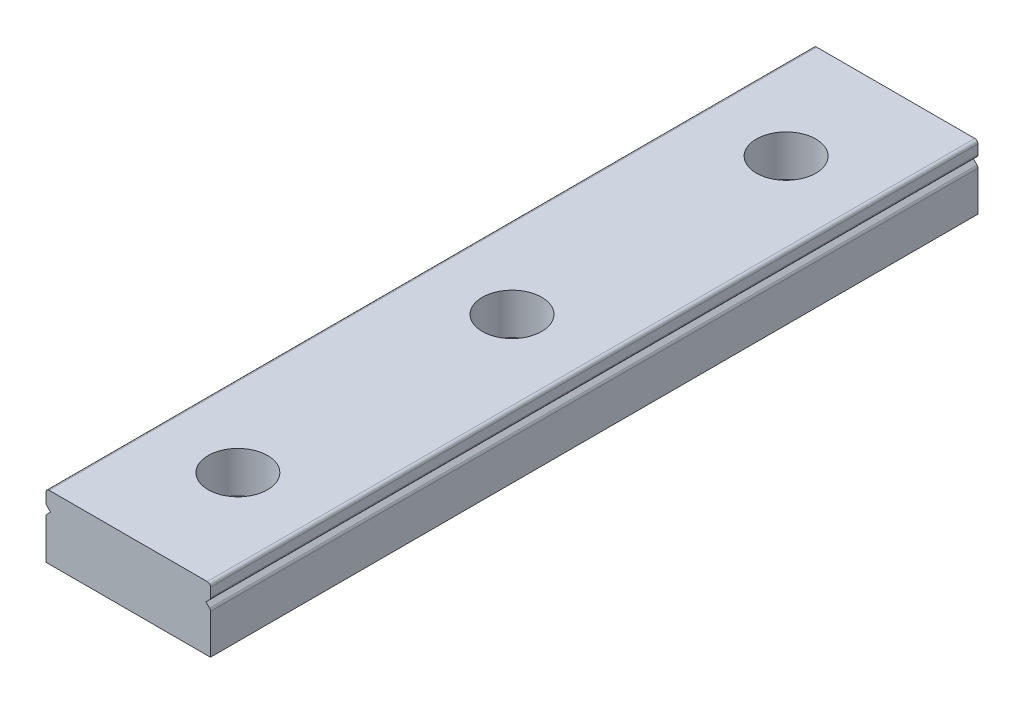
ISO-10303-21;
HEADER;
FILE_DESCRIPTION(('STEP AP214'),'2;1');
FILE_NAME('part.step','',(''),(''),'','','');
FILE_SCHEMA(('AUTOMOTIVE_DESIGN { 1 0 10303 214 1 1 1 1 }'));
ENDSEC;
DATA;
#1=APPLICATION_CONTEXT('core data for automotive mechanical design processes');
#2=APPLICATION_PROTOCOL_DEFINITION('international standard','automotive_design',2000,#1);
#3=PRODUCT_CONTEXT('',#1,'mechanical');
#4=PRODUCT('Part','Part','',(#3));
#5=PRODUCT_RELATED_PRODUCT_CATEGORY('part','',(#4));
#6=PRODUCT_DEFINITION_FORMATION('','',#4);
#7=PRODUCT_DEFINITION_CONTEXT('part definition',#1,'design');
#8=PRODUCT_DEFINITION('design','',#6,#7);
#9=PRODUCT_DEFINITION_SHAPE('','',#8);
#10=(LENGTH_UNIT() NAMED_UNIT(*) SI_UNIT(.MILLI.,.METRE.));
#11=(NAMED_UNIT(*) PLANE_ANGLE_UNIT() SI_UNIT($,.RADIAN.));
#12=(NAMED_UNIT(*) SI_UNIT($,.STERADIAN.) SOLID_ANGLE_UNIT());
#13=UNCERTAINTY_MEASURE_WITH_UNIT(LENGTH_MEASURE(1.E-05),#10,'distance_accuracy_value','');
#14=(GEOMETRIC_REPRESENTATION_CONTEXT(3) GLOBAL_UNCERTAINTY_ASSIGNED_CONTEXT((#13)) GLOBAL_UNIT_ASSIGNED_CONTEXT((#10,
#11,#12)) REPRESENTATION_CONTEXT('',''));
#15=CARTESIAN_POINT('',(0.,0.,0.));
#16=DIRECTION('',(0.,0.,1.));
#17=DIRECTION('',(1.,0.,0.));
#18=AXIS2_PLACEMENT_3D('',#15,#16,#17);
#19=CARTESIAN_POINT('',(0.,0.,84.));
#20=DIRECTION('',(0.,1.,0.));
#21=DIRECTION('',(0.,0.,1.));
#22=AXIS2_PLACEMENT_3D('',#19,#20,#21);
#23=PLANE('',#22);
#24=CARTESIAN_POINT('',(0.,0.,42.));
#25=DIRECTION('',(0.,1.,0.));
#26=DIRECTION('',(0.,0.,1.));
#27=AXIS2_PLACEMENT_3D('',#24,#25,#26);
#28=CIRCLE('',#27,1.75);
#29=CARTESIAN_POINT('',(0.,0.,43.75));
#30=VERTEX_POINT('',#29);
#31=EDGE_CURVE('E686',#30,#30,#28,.T.);
#32=ORIENTED_EDGE('',*,*,#31,.T.);
#33=EDGE_LOOP('',(#32));
#34=FACE_BOUND('',#33,.T.);
#35=CARTESIAN_POINT('',(0.,0.,12.));
#36=DIRECTION('',(0.,1.,0.));
#37=DIRECTION('',(0.,0.,1.));
#38=AXIS2_PLACEMENT_3D('',#35,#36,#37);
#39=CIRCLE('',#38,1.75);
#40=CARTESIAN_POINT('',(0.,0.,13.75));
#41=VERTEX_POINT('',#40);
#42=EDGE_CURVE('E671',#41,#41,#39,.T.);
#43=ORIENTED_EDGE('',*,*,#42,.T.);
#44=EDGE_LOOP('',(#43));
#45=FACE_BOUND('',#44,.T.);
#46=DIRECTION('',(1.,0.,0.));
#47=VECTOR('',#46,1.);
#48=CARTESIAN_POINT('',(0.,0.,0.));
#49=LINE('',#48,#47);
#50=CARTESIAN_POINT('',(-9.,0.,0.));
#51=VERTEX_POINT('',#50);
#52=CARTESIAN_POINT('',(9.,0.,0.));
#53=VERTEX_POINT('',#52);
#54=EDGE_CURVE('E184',#51,#53,#49,.T.);
#55=ORIENTED_EDGE('',*,*,#54,.T.);
#56=DIRECTION('',(0.,0.,-1.));
#57=VECTOR('',#56,1.);
#58=CARTESIAN_POINT('',(9.,0.,84.));
#59=LINE('',#58,#57);
#60=CARTESIAN_POINT('',(9.,0.,84.));
#61=VERTEX_POINT('',#60);
#62=EDGE_CURVE('E257',#61,#53,#59,.T.);
#63=ORIENTED_EDGE('',*,*,#62,.F.);
#64=DIRECTION('',(1.,0.,0.));
#65=VECTOR('',#64,1.);
#66=CARTESIAN_POINT('',(0.,0.,84.));
#67=LINE('',#66,#65);
#68=CARTESIAN_POINT('',(-9.,0.,84.));
#69=VERTEX_POINT('',#68);
#70=EDGE_CURVE('E213',#69,#61,#67,.T.);
#71=ORIENTED_EDGE('',*,*,#70,.F.);
#72=DIRECTION('',(0.,0.,-1.));
#73=VECTOR('',#72,1.);
#74=CARTESIAN_POINT('',(-9.,0.,84.));
#75=LINE('',#74,#73);
#76=EDGE_CURVE('E185',#69,#51,#75,.T.);
#77=ORIENTED_EDGE('',*,*,#76,.T.);
#78=EDGE_LOOP('',(#55,#63,#71,#77));
#79=FACE_BOUND('',#78,.T.);
#80=CARTESIAN_POINT('',(0.,0.,72.));
#81=DIRECTION('',(0.,1.,0.));
#82=DIRECTION('',(0.,0.,1.));
#83=AXIS2_PLACEMENT_3D('',#80,#81,#82);
#84=CIRCLE('',#83,1.75);
#85=CARTESIAN_POINT('',(0.,0.,73.75));
#86=VERTEX_POINT('',#85);
#87=EDGE_CURVE('E328',#86,#86,#84,.T.);
#88=ORIENTED_EDGE('',*,*,#87,.T.);
#89=EDGE_LOOP('',(#88));
#90=FACE_BOUND('',#89,.T.);
#91=ADVANCED_FACE('F41',(#34,#45,#79,#90),#23,.F.);
#92=CARTESIAN_POINT('',(9.,0.,84.));
#93=DIRECTION('',(-1.,0.,0.));
#94=DIRECTION('',(0.,0.,1.));
#95=AXIS2_PLACEMENT_3D('',#92,#93,#94);
#96=PLANE('',#95);
#97=DIRECTION('',(0.,1.,0.));
#98=VECTOR('',#97,1.);
#99=CARTESIAN_POINT('',(9.,0.,0.));
#100=LINE('',#99,#98);
#101=CARTESIAN_POINT('',(9.,4.35502525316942,0.));
#102=VERTEX_POINT('',#101);
#103=EDGE_CURVE('E238',#53,#102,#100,.T.);
#104=ORIENTED_EDGE('',*,*,#103,.T.);
#105=DIRECTION('',(0.,0.,-1.));
#106=VECTOR('',#105,1.);
#107=CARTESIAN_POINT('',(9.,4.35502525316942,84.));
#108=LINE('',#107,#106);
#109=CARTESIAN_POINT('',(9.,4.35502525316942,84.));
#110=VERTEX_POINT('',#109);
#111=EDGE_CURVE('E295',#102,#110,#108,.F.);
#112=ORIENTED_EDGE('',*,*,#111,.T.);
#113=DIRECTION('',(0.,1.,0.));
#114=VECTOR('',#113,1.);
#115=CARTESIAN_POINT('',(9.,0.,84.));
#116=LINE('',#115,#114);
#117=EDGE_CURVE('E216',#61,#110,#116,.T.);
#118=ORIENTED_EDGE('',*,*,#117,.F.);
#119=ORIENTED_EDGE('',*,*,#62,.T.);
#120=EDGE_LOOP('',(#104,#112,#118,#119));
#121=FACE_BOUND('',#120,.T.);
#122=ADVANCED_FACE('F364',(#121),#96,.F.);
#123=CARTESIAN_POINT('',(8.5,5.,84.));
#124=DIRECTION('',(-0.707106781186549,-0.707106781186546,0.));
#125=DIRECTION('',(0.707106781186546,-0.707106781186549,0.));
#126=AXIS2_PLACEMENT_3D('',#123,#124,#125);
#127=PLANE('',#126);
#128=DIRECTION('',(-0.707106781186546,0.707106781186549,0.));
#129=VECTOR('',#128,1.);
#130=CARTESIAN_POINT('',(8.5,5.,84.));
#131=LINE('',#130,#129);
#132=CARTESIAN_POINT('',(8.89748737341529,4.60251262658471,84.));
#133=VERTEX_POINT('',#132);
#134=CARTESIAN_POINT('',(8.5,5.,84.));
#135=VERTEX_POINT('',#134);
#136=EDGE_CURVE('E221',#133,#135,#131,.T.);
#137=ORIENTED_EDGE('',*,*,#136,.F.);
#138=DIRECTION('',(0.,0.,-1.));
#139=VECTOR('',#138,1.);
#140=CARTESIAN_POINT('',(8.89748737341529,4.60251262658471,84.));
#141=LINE('',#140,#139);
#142=CARTESIAN_POINT('',(8.89748737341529,4.60251262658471,0.));
#143=VERTEX_POINT('',#142);
#144=EDGE_CURVE('E291',#133,#143,#141,.T.);
#145=ORIENTED_EDGE('',*,*,#144,.T.);
#146=DIRECTION('',(-0.707106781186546,0.707106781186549,0.));
#147=VECTOR('',#146,1.);
#148=CARTESIAN_POINT('',(8.5,5.,0.));
#149=LINE('',#148,#147);
#150=CARTESIAN_POINT('',(8.5,5.,0.));
#151=VERTEX_POINT('',#150);
#152=EDGE_CURVE('E242',#143,#151,#149,.T.);
#153=ORIENTED_EDGE('',*,*,#152,.T.);
#154=DIRECTION('',(0.,0.,-1.));
#155=VECTOR('',#154,1.);
#156=CARTESIAN_POINT('',(8.5,5.,84.));
#157=LINE('',#156,#155);
#158=EDGE_CURVE('E235',#135,#151,#157,.T.);
#159=ORIENTED_EDGE('',*,*,#158,.F.);
#160=EDGE_LOOP('',(#137,#145,#153,#159));
#161=FACE_BOUND('',#160,.T.);
#162=ADVANCED_FACE('F370',(#161),#127,.F.);
#163=CARTESIAN_POINT('',(9.,5.5,84.));
#164=DIRECTION('',(-0.707106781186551,0.707106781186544,0.));
#165=DIRECTION('',(-0.707106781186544,-0.707106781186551,0.));
#166=AXIS2_PLACEMENT_3D('',#163,#164,#165);
#167=PLANE('',#166);
#168=DIRECTION('',(0.707106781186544,0.707106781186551,0.));
#169=VECTOR('',#168,1.);
#170=CARTESIAN_POINT('',(9.,5.5,0.));
#171=LINE('',#170,#169);
#172=CARTESIAN_POINT('',(8.89748737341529,5.39748737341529,0.));
#173=VERTEX_POINT('',#172);
#174=EDGE_CURVE('E244',#151,#173,#171,.T.);
#175=ORIENTED_EDGE('',*,*,#174,.T.);
#176=DIRECTION('',(0.,0.,-1.));
#177=VECTOR('',#176,1.);
#178=CARTESIAN_POINT('',(8.89748737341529,5.39748737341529,84.));
#179=LINE('',#178,#177);
#180=CARTESIAN_POINT('',(8.89748737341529,5.39748737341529,84.));
#181=VERTEX_POINT('',#180);
#182=EDGE_CURVE('E288',#173,#181,#179,.F.);
#183=ORIENTED_EDGE('',*,*,#182,.T.);
#184=DIRECTION('',(0.707106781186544,0.707106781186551,0.));
#185=VECTOR('',#184,1.);
#186=CARTESIAN_POINT('',(9.,5.5,84.));
#187=LINE('',#186,#185);
#188=EDGE_CURVE('E224',#135,#181,#187,.T.);
#189=ORIENTED_EDGE('',*,*,#188,.F.);
#190=ORIENTED_EDGE('',*,*,#158,.T.);
#191=EDGE_LOOP('',(#175,#183,#189,#190));
#192=FACE_BOUND('',#191,.T.);
#193=ADVANCED_FACE('F357',(#192),#167,.F.);
#194=CARTESIAN_POINT('',(9.,7.,84.));
#195=DIRECTION('',(-1.,0.,0.));
#196=DIRECTION('',(0.,-1.,0.));
#197=AXIS2_PLACEMENT_3D('',#194,#195,#196);
#198=PLANE('',#197);
#199=DIRECTION('',(0.,1.,0.));
#200=VECTOR('',#199,1.);
#201=CARTESIAN_POINT('',(9.,7.,0.));
#202=LINE('',#201,#200);
#203=CARTESIAN_POINT('',(9.,5.64497474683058,0.));
#204=VERTEX_POINT('',#203);
#205=CARTESIAN_POINT('',(9.,6.65,0.));
#206=VERTEX_POINT('',#205);
#207=EDGE_CURVE('E247',#204,#206,#202,.T.);
#208=ORIENTED_EDGE('',*,*,#207,.T.);
#209=DIRECTION('',(0.,0.,-1.));
#210=VECTOR('',#209,1.);
#211=CARTESIAN_POINT('',(9.,6.65,84.));
#212=LINE('',#211,#210);
#213=CARTESIAN_POINT('',(9.,6.65,84.));
#214=VERTEX_POINT('',#213);
#215=EDGE_CURVE('E276',#206,#214,#212,.F.);
#216=ORIENTED_EDGE('',*,*,#215,.T.);
#217=DIRECTION('',(0.,1.,0.));
#218=VECTOR('',#217,1.);
#219=CARTESIAN_POINT('',(9.,7.,84.));
#220=LINE('',#219,#218);
#221=CARTESIAN_POINT('',(9.,5.64497474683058,84.));
#222=VERTEX_POINT('',#221);
#223=EDGE_CURVE('E228',#222,#214,#220,.T.);
#224=ORIENTED_EDGE('',*,*,#223,.F.);
#225=DIRECTION('',(0.,0.,-1.));
#226=VECTOR('',#225,1.);
#227=CARTESIAN_POINT('',(9.,5.64497474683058,84.));
#228=LINE('',#227,#226);
#229=EDGE_CURVE('E272',#222,#204,#228,.T.);
#230=ORIENTED_EDGE('',*,*,#229,.T.);
#231=EDGE_LOOP('',(#208,#216,#224,#230));
#232=FACE_BOUND('',#231,.T.);
#233=ADVANCED_FACE('F348',(#232),#198,.F.);
#234=CARTESIAN_POINT('',(0.,7.,84.));
#235=DIRECTION('',(0.,-1.,0.));
#236=DIRECTION('',(0.,0.,-1.));
#237=AXIS2_PLACEMENT_3D('',#234,#235,#236);
#238=PLANE('',#237);
#239=CARTESIAN_POINT('',(0.,7.,42.));
#240=DIRECTION('',(0.,1.,0.));
#241=DIRECTION('',(0.,0.,1.));
#242=AXIS2_PLACEMENT_3D('',#239,#240,#241);
#243=CIRCLE('',#242,3.25);
#244=CARTESIAN_POINT('',(0.,7.,45.25));
#245=VERTEX_POINT('',#244);
#246=EDGE_CURVE('E682',#245,#245,#243,.T.);
#247=ORIENTED_EDGE('',*,*,#246,.F.);
#248=EDGE_LOOP('',(#247));
#249=FACE_BOUND('',#248,.T.);
#250=CARTESIAN_POINT('',(0.,7.,12.));
#251=DIRECTION('',(0.,1.,0.));
#252=DIRECTION('',(0.,0.,1.));
#253=AXIS2_PLACEMENT_3D('',#250,#251,#252);
#254=CIRCLE('',#253,3.25);
#255=CARTESIAN_POINT('',(0.,7.,15.25));
#256=VERTEX_POINT('',#255);
#257=EDGE_CURVE('E204',#256,#256,#254,.T.);
#258=ORIENTED_EDGE('',*,*,#257,.F.);
#259=EDGE_LOOP('',(#258));
#260=FACE_BOUND('',#259,.T.);
#261=DIRECTION('',(-1.,0.,0.));
#262=VECTOR('',#261,1.);
#263=CARTESIAN_POINT('',(0.,7.,0.));
#264=LINE('',#263,#262);
#265=CARTESIAN_POINT('',(8.65,7.,0.));
#266=VERTEX_POINT('',#265);
#267=CARTESIAN_POINT('',(-8.65,7.,0.));
#268=VERTEX_POINT('',#267);
#269=EDGE_CURVE('E217',#266,#268,#264,.T.);
#270=ORIENTED_EDGE('',*,*,#269,.T.);
#271=DIRECTION('',(0.,0.,-1.));
#272=VECTOR('',#271,1.);
#273=CARTESIAN_POINT('',(-8.65,7.,84.));
#274=LINE('',#273,#272);
#275=CARTESIAN_POINT('',(-8.65,7.,84.));
#276=VERTEX_POINT('',#275);
#277=EDGE_CURVE('E312',#268,#276,#274,.F.);
#278=ORIENTED_EDGE('',*,*,#277,.T.);
#279=DIRECTION('',(-1.,0.,0.));
#280=VECTOR('',#279,1.);
#281=CARTESIAN_POINT('',(0.,7.,84.));
#282=LINE('',#281,#280);
#283=CARTESIAN_POINT('',(8.65,7.,84.));
#284=VERTEX_POINT('',#283);
#285=EDGE_CURVE('E232',#284,#276,#282,.T.);
#286=ORIENTED_EDGE('',*,*,#285,.F.);
#287=DIRECTION('',(0.,0.,-1.));
#288=VECTOR('',#287,1.);
#289=CARTESIAN_POINT('',(8.65,7.,84.));
#290=LINE('',#289,#288);
#291=EDGE_CURVE('E261',#284,#266,#290,.T.);
#292=ORIENTED_EDGE('',*,*,#291,.T.);
#293=EDGE_LOOP('',(#270,#278,#286,#292));
#294=FACE_BOUND('',#293,.T.);
#295=CARTESIAN_POINT('',(0.,7.,72.));
#296=DIRECTION('',(0.,1.,0.));
#297=DIRECTION('',(0.,0.,1.));
#298=AXIS2_PLACEMENT_3D('',#295,#296,#297);
#299=CIRCLE('',#298,3.25);
#300=CARTESIAN_POINT('',(0.,7.,75.25));
#301=VERTEX_POINT('',#300);
#302=EDGE_CURVE('E331',#301,#301,#299,.T.);
#303=ORIENTED_EDGE('',*,*,#302,.F.);
#304=EDGE_LOOP('',(#303));
#305=FACE_BOUND('',#304,.T.);
#306=ADVANCED_FACE('F346',(#249,#260,#294,#305),#238,.F.);
#307=CARTESIAN_POINT('',(0.,0.,84.));
#308=DIRECTION('',(0.,0.,1.));
#309=DIRECTION('',(1.,0.,0.));
#310=AXIS2_PLACEMENT_3D('',#307,#308,#309);
#311=PLANE('',#310);
#312=ORIENTED_EDGE('',*,*,#285,.T.);
#313=CARTESIAN_POINT('',(-8.65,6.65,84.));
#314=DIRECTION('',(0.,0.,1.));
#315=DIRECTION('',(1.,0.,0.));
#316=AXIS2_PLACEMENT_3D('',#313,#314,#315);
#317=CIRCLE('',#316,0.35);
#318=CARTESIAN_POINT('',(-9.,6.65,84.));
#319=VERTEX_POINT('',#318);
#320=EDGE_CURVE('E317',#276,#319,#317,.T.);
#321=ORIENTED_EDGE('',*,*,#320,.T.);
#322=DIRECTION('',(0.,1.,0.));
#323=VECTOR('',#322,1.);
#324=CARTESIAN_POINT('',(-9.,7.,84.));
#325=LINE('',#324,#323);
#326=CARTESIAN_POINT('',(-9.,5.64497474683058,84.));
#327=VERTEX_POINT('',#326);
#328=EDGE_CURVE('E192',#327,#319,#325,.T.);
#329=ORIENTED_EDGE('',*,*,#328,.F.);
#330=CARTESIAN_POINT('',(-8.65,5.64497474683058,84.));
#331=DIRECTION('',(0.,0.,1.));
#332=DIRECTION('',(1.,0.,0.));
#333=AXIS2_PLACEMENT_3D('',#330,#331,#332);
#334=CIRCLE('',#333,0.35);
#335=CARTESIAN_POINT('',(-8.89748737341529,5.39748737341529,84.));
#336=VERTEX_POINT('',#335);
#337=EDGE_CURVE('E191',#327,#336,#334,.T.);
#338=ORIENTED_EDGE('',*,*,#337,.T.);
#339=DIRECTION('',(-0.707106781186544,0.707106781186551,0.));
#340=VECTOR('',#339,1.);
#341=CARTESIAN_POINT('',(-9.,5.5,84.));
#342=LINE('',#341,#340);
#343=CARTESIAN_POINT('',(-8.5,5.,84.));
#344=VERTEX_POINT('',#343);
#345=EDGE_CURVE('E174',#344,#336,#342,.T.);
#346=ORIENTED_EDGE('',*,*,#345,.F.);
#347=DIRECTION('',(0.707106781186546,0.707106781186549,0.));
#348=VECTOR('',#347,1.);
#349=CARTESIAN_POINT('',(-8.5,5.,84.));
#350=LINE('',#349,#348);
#351=CARTESIAN_POINT('',(-8.89748737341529,4.60251262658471,84.));
#352=VERTEX_POINT('',#351);
#353=EDGE_CURVE('E167',#352,#344,#350,.T.);
#354=ORIENTED_EDGE('',*,*,#353,.F.);
#355=CARTESIAN_POINT('',(-8.65,4.35502525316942,84.));
#356=DIRECTION('',(0.,0.,1.));
#357=DIRECTION('',(1.,0.,0.));
#358=AXIS2_PLACEMENT_3D('',#355,#356,#357);
#359=CIRCLE('',#358,0.35);
#360=CARTESIAN_POINT('',(-9.,4.35502525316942,84.));
#361=VERTEX_POINT('',#360);
#362=EDGE_CURVE('E56',#352,#361,#359,.T.);
#363=ORIENTED_EDGE('',*,*,#362,.T.);
#364=DIRECTION('',(0.,1.,0.));
#365=VECTOR('',#364,1.);
#366=CARTESIAN_POINT('',(-9.,0.,84.));
#367=LINE('',#366,#365);
#368=EDGE_CURVE('E173',#69,#361,#367,.T.);
#369=ORIENTED_EDGE('',*,*,#368,.F.);
#370=ORIENTED_EDGE('',*,*,#70,.T.);
#371=ORIENTED_EDGE('',*,*,#117,.T.);
#372=CARTESIAN_POINT('',(8.65,4.35502525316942,84.));
#373=DIRECTION('',(0.,0.,1.));
#374=DIRECTION('',(1.,0.,0.));
#375=AXIS2_PLACEMENT_3D('',#372,#373,#374);
#376=CIRCLE('',#375,0.35);
#377=EDGE_CURVE('E279',#110,#133,#376,.T.);
#378=ORIENTED_EDGE('',*,*,#377,.T.);
#379=ORIENTED_EDGE('',*,*,#136,.T.);
#380=ORIENTED_EDGE('',*,*,#188,.T.);
#381=CARTESIAN_POINT('',(8.65,5.64497474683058,84.));
#382=DIRECTION('',(0.,0.,1.));
#383=DIRECTION('',(1.,0.,0.));
#384=AXIS2_PLACEMENT_3D('',#381,#382,#383);
#385=CIRCLE('',#384,0.35);
#386=EDGE_CURVE('E282',#181,#222,#385,.T.);
#387=ORIENTED_EDGE('',*,*,#386,.T.);
#388=ORIENTED_EDGE('',*,*,#223,.T.);
#389=CARTESIAN_POINT('',(8.65,6.65,84.));
#390=DIRECTION('',(0.,0.,1.));
#391=DIRECTION('',(1.,0.,0.));
#392=AXIS2_PLACEMENT_3D('',#389,#390,#391);
#393=CIRCLE('',#392,0.35);
#394=EDGE_CURVE('E285',#214,#284,#393,.T.);
#395=ORIENTED_EDGE('',*,*,#394,.T.);
#396=EDGE_LOOP('',(#312,#321,#329,#338,#346,#354,#363,#369,#370,#371,#378,#379,#380,#387,#388,#395));
#397=FACE_BOUND('',#396,.T.);
#398=ADVANCED_FACE('F188',(#397),#311,.T.);
#399=CARTESIAN_POINT('',(0.,0.,0.));
#400=DIRECTION('',(0.,0.,1.));
#401=DIRECTION('',(1.,0.,0.));
#402=AXIS2_PLACEMENT_3D('',#399,#400,#401);
#403=PLANE('',#402);
#404=DIRECTION('',(0.,1.,0.));
#405=VECTOR('',#404,1.);
#406=CARTESIAN_POINT('',(-9.,7.,0.));
#407=LINE('',#406,#405);
#408=CARTESIAN_POINT('',(-9.,5.64497474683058,0.));
#409=VERTEX_POINT('',#408);
#410=CARTESIAN_POINT('',(-9.,6.65,0.));
#411=VERTEX_POINT('',#410);
#412=EDGE_CURVE('E200',#409,#411,#407,.T.);
#413=ORIENTED_EDGE('',*,*,#412,.T.);
#414=CARTESIAN_POINT('',(-8.65,6.65,0.));
#415=DIRECTION('',(0.,0.,1.));
#416=DIRECTION('',(1.,0.,0.));
#417=AXIS2_PLACEMENT_3D('',#414,#415,#416);
#418=CIRCLE('',#417,0.35);
#419=EDGE_CURVE('E309',#411,#268,#418,.F.);
#420=ORIENTED_EDGE('',*,*,#419,.T.);
#421=ORIENTED_EDGE('',*,*,#269,.F.);
#422=CARTESIAN_POINT('',(8.65,6.65,0.));
#423=DIRECTION('',(0.,0.,1.));
#424=DIRECTION('',(1.,0.,0.));
#425=AXIS2_PLACEMENT_3D('',#422,#423,#424);
#426=CIRCLE('',#425,0.35);
#427=EDGE_CURVE('E269',#266,#206,#426,.F.);
#428=ORIENTED_EDGE('',*,*,#427,.T.);
#429=ORIENTED_EDGE('',*,*,#207,.F.);
#430=CARTESIAN_POINT('',(8.65,5.64497474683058,0.));
#431=DIRECTION('',(0.,0.,1.));
#432=DIRECTION('',(1.,0.,0.));
#433=AXIS2_PLACEMENT_3D('',#430,#431,#432);
#434=CIRCLE('',#433,0.35);
#435=EDGE_CURVE('E267',#204,#173,#434,.F.);
#436=ORIENTED_EDGE('',*,*,#435,.T.);
#437=ORIENTED_EDGE('',*,*,#174,.F.);
#438=ORIENTED_EDGE('',*,*,#152,.F.);
#439=CARTESIAN_POINT('',(8.65,4.35502525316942,0.));
#440=DIRECTION('',(0.,0.,1.));
#441=DIRECTION('',(1.,0.,0.));
#442=AXIS2_PLACEMENT_3D('',#439,#440,#441);
#443=CIRCLE('',#442,0.35);
#444=EDGE_CURVE('E265',#143,#102,#443,.F.);
#445=ORIENTED_EDGE('',*,*,#444,.T.);
#446=ORIENTED_EDGE('',*,*,#103,.F.);
#447=ORIENTED_EDGE('',*,*,#54,.F.);
#448=DIRECTION('',(0.,1.,0.));
#449=VECTOR('',#448,1.);
#450=CARTESIAN_POINT('',(-9.,0.,0.));
#451=LINE('',#450,#449);
#452=CARTESIAN_POINT('',(-9.,4.35502525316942,0.));
#453=VERTEX_POINT('',#452);
#454=EDGE_CURVE('E195',#51,#453,#451,.T.);
#455=ORIENTED_EDGE('',*,*,#454,.T.);
#456=CARTESIAN_POINT('',(-8.65,4.35502525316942,0.));
#457=DIRECTION('',(0.,0.,1.));
#458=DIRECTION('',(1.,0.,0.));
#459=AXIS2_PLACEMENT_3D('',#456,#457,#458);
#460=CIRCLE('',#459,0.35);
#461=CARTESIAN_POINT('',(-8.89748737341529,4.60251262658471,0.));
#462=VERTEX_POINT('',#461);
#463=EDGE_CURVE('E305',#453,#462,#460,.F.);
#464=ORIENTED_EDGE('',*,*,#463,.T.);
#465=DIRECTION('',(0.707106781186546,0.707106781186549,0.));
#466=VECTOR('',#465,1.);
#467=CARTESIAN_POINT('',(-8.5,5.,0.));
#468=LINE('',#467,#466);
#469=CARTESIAN_POINT('',(-8.5,5.,0.));
#470=VERTEX_POINT('',#469);
#471=EDGE_CURVE('E206',#462,#470,#468,.T.);
#472=ORIENTED_EDGE('',*,*,#471,.T.);
#473=DIRECTION('',(-0.707106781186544,0.707106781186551,0.));
#474=VECTOR('',#473,1.);
#475=CARTESIAN_POINT('',(-9.,5.5,0.));
#476=LINE('',#475,#474);
#477=CARTESIAN_POINT('',(-8.89748737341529,5.39748737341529,0.));
#478=VERTEX_POINT('',#477);
#479=EDGE_CURVE('E182',#470,#478,#476,.T.);
#480=ORIENTED_EDGE('',*,*,#479,.T.);
#481=CARTESIAN_POINT('',(-8.65,5.64497474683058,0.));
#482=DIRECTION('',(0.,0.,1.));
#483=DIRECTION('',(1.,0.,0.));
#484=AXIS2_PLACEMENT_3D('',#481,#482,#483);
#485=CIRCLE('',#484,0.35);
#486=EDGE_CURVE('E307',#478,#409,#485,.F.);
#487=ORIENTED_EDGE('',*,*,#486,.T.);
#488=EDGE_LOOP('',(#413,#420,#421,#428,#429,#436,#437,#438,#445,#446,#447,#455,#464,#472,#480,#487));
#489=FACE_BOUND('',#488,.T.);
#490=ADVANCED_FACE('F355',(#489),#403,.F.);
#491=CARTESIAN_POINT('',(8.65,6.65,84.));
#492=DIRECTION('',(0.,0.,-1.));
#493=DIRECTION('',(-1.,0.,0.));
#494=AXIS2_PLACEMENT_3D('',#491,#492,#493);
#495=CYLINDRICAL_SURFACE('',#494,0.35);
#496=ORIENTED_EDGE('',*,*,#394,.F.);
#497=ORIENTED_EDGE('',*,*,#215,.F.);
#498=ORIENTED_EDGE('',*,*,#427,.F.);
#499=ORIENTED_EDGE('',*,*,#291,.F.);
#500=EDGE_LOOP('',(#496,#497,#498,#499));
#501=FACE_BOUND('',#500,.T.);
#502=ADVANCED_FACE('F377',(#501),#495,.T.);
#503=CARTESIAN_POINT('',(8.65,5.64497474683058,84.));
#504=DIRECTION('',(0.,0.,-1.));
#505=DIRECTION('',(-1.,0.,0.));
#506=AXIS2_PLACEMENT_3D('',#503,#504,#505);
#507=CYLINDRICAL_SURFACE('',#506,0.35);
#508=ORIENTED_EDGE('',*,*,#386,.F.);
#509=ORIENTED_EDGE('',*,*,#182,.F.);
#510=ORIENTED_EDGE('',*,*,#435,.F.);
#511=ORIENTED_EDGE('',*,*,#229,.F.);
#512=EDGE_LOOP('',(#508,#509,#510,#511));
#513=FACE_BOUND('',#512,.T.);
#514=ADVANCED_FACE('F380',(#513),#507,.T.);
#515=CARTESIAN_POINT('',(8.65,4.35502525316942,84.));
#516=DIRECTION('',(0.,0.,-1.));
#517=DIRECTION('',(-1.,0.,0.));
#518=AXIS2_PLACEMENT_3D('',#515,#516,#517);
#519=CYLINDRICAL_SURFACE('',#518,0.35);
#520=ORIENTED_EDGE('',*,*,#377,.F.);
#521=ORIENTED_EDGE('',*,*,#111,.F.);
#522=ORIENTED_EDGE('',*,*,#444,.F.);
#523=ORIENTED_EDGE('',*,*,#144,.F.);
#524=EDGE_LOOP('',(#520,#521,#522,#523));
#525=FACE_BOUND('',#524,.T.);
#526=ADVANCED_FACE('F384',(#525),#519,.T.);
#527=CARTESIAN_POINT('',(-9.,7.,84.));
#528=DIRECTION('',(-1.,0.,0.));
#529=DIRECTION('',(0.,-1.,0.));
#530=AXIS2_PLACEMENT_3D('',#527,#528,#529);
#531=PLANE('',#530);
#532=ORIENTED_EDGE('',*,*,#328,.T.);
#533=DIRECTION('',(0.,0.,-1.));
#534=VECTOR('',#533,1.);
#535=CARTESIAN_POINT('',(-9.,6.65,0.));
#536=LINE('',#535,#534);
#537=EDGE_CURVE('E301',#319,#411,#536,.T.);
#538=ORIENTED_EDGE('',*,*,#537,.T.);
#539=ORIENTED_EDGE('',*,*,#412,.F.);
#540=DIRECTION('',(0.,0.,-1.));
#541=VECTOR('',#540,1.);
#542=CARTESIAN_POINT('',(-9.,5.64497474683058,84.));
#543=LINE('',#542,#541);
#544=EDGE_CURVE('E298',#409,#327,#543,.F.);
#545=ORIENTED_EDGE('',*,*,#544,.T.);
#546=EDGE_LOOP('',(#532,#538,#539,#545));
#547=FACE_BOUND('',#546,.T.);
#548=ADVANCED_FACE('F388',(#547),#531,.T.);
#549=CARTESIAN_POINT('',(-9.,5.5,84.));
#550=DIRECTION('',(-0.707106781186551,-0.707106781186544,0.));
#551=DIRECTION('',(0.707106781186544,-0.707106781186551,0.));
#552=AXIS2_PLACEMENT_3D('',#549,#550,#551);
#553=PLANE('',#552);
#554=ORIENTED_EDGE('',*,*,#345,.T.);
#555=DIRECTION('',(0.,0.,-1.));
#556=VECTOR('',#555,1.);
#557=CARTESIAN_POINT('',(-8.89748737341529,5.39748737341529,84.));
#558=LINE('',#557,#556);
#559=EDGE_CURVE('E319',#336,#478,#558,.T.);
#560=ORIENTED_EDGE('',*,*,#559,.T.);
#561=ORIENTED_EDGE('',*,*,#479,.F.);
#562=DIRECTION('',(0.,0.,-1.));
#563=VECTOR('',#562,1.);
#564=CARTESIAN_POINT('',(-8.5,5.,84.));
#565=LINE('',#564,#563);
#566=EDGE_CURVE('E170',#344,#470,#565,.T.);
#567=ORIENTED_EDGE('',*,*,#566,.F.);
#568=EDGE_LOOP('',(#554,#560,#561,#567));
#569=FACE_BOUND('',#568,.T.);
#570=ADVANCED_FACE('F178',(#569),#553,.T.);
#571=CARTESIAN_POINT('',(-8.5,5.,84.));
#572=DIRECTION('',(-0.707106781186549,0.707106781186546,0.));
#573=DIRECTION('',(-0.707106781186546,-0.707106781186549,0.));
#574=AXIS2_PLACEMENT_3D('',#571,#572,#573);
#575=PLANE('',#574);
#576=ORIENTED_EDGE('',*,*,#471,.F.);
#577=DIRECTION('',(0.,0.,-1.));
#578=VECTOR('',#577,1.);
#579=CARTESIAN_POINT('',(-8.89748737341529,4.60251262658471,84.));
#580=LINE('',#579,#578);
#581=EDGE_CURVE('E64',#462,#352,#580,.F.);
#582=ORIENTED_EDGE('',*,*,#581,.T.);
#583=ORIENTED_EDGE('',*,*,#353,.T.);
#584=ORIENTED_EDGE('',*,*,#566,.T.);
#585=EDGE_LOOP('',(#576,#582,#583,#584));
#586=FACE_BOUND('',#585,.T.);
#587=ADVANCED_FACE('F169',(#586),#575,.T.);
#588=CARTESIAN_POINT('',(-9.,0.,84.));
#589=DIRECTION('',(-1.,0.,0.));
#590=DIRECTION('',(0.,0.,1.));
#591=AXIS2_PLACEMENT_3D('',#588,#589,#590);
#592=PLANE('',#591);
#593=ORIENTED_EDGE('',*,*,#368,.T.);
#594=DIRECTION('',(0.,0.,-1.));
#595=VECTOR('',#594,1.);
#596=CARTESIAN_POINT('',(-9.,4.35502525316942,84.));
#597=LINE('',#596,#595);
#598=EDGE_CURVE('E322',#361,#453,#597,.T.);
#599=ORIENTED_EDGE('',*,*,#598,.T.);
#600=ORIENTED_EDGE('',*,*,#454,.F.);
#601=ORIENTED_EDGE('',*,*,#76,.F.);
#602=EDGE_LOOP('',(#593,#599,#600,#601));
#603=FACE_BOUND('',#602,.T.);
#604=ADVANCED_FACE('F394',(#603),#592,.T.);
#605=CARTESIAN_POINT('',(-8.65,6.65,84.));
#606=DIRECTION('',(0.,0.,1.));
#607=DIRECTION('',(1.,0.,0.));
#608=AXIS2_PLACEMENT_3D('',#605,#606,#607);
#609=CYLINDRICAL_SURFACE('',#608,0.35);
#610=ORIENTED_EDGE('',*,*,#320,.F.);
#611=ORIENTED_EDGE('',*,*,#277,.F.);
#612=ORIENTED_EDGE('',*,*,#419,.F.);
#613=ORIENTED_EDGE('',*,*,#537,.F.);
#614=EDGE_LOOP('',(#610,#611,#612,#613));
#615=FACE_BOUND('',#614,.T.);
#616=ADVANCED_FACE('F390',(#615),#609,.T.);
#617=CARTESIAN_POINT('',(-8.65,5.64497474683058,84.));
#618=DIRECTION('',(0.,0.,-1.));
#619=DIRECTION('',(-1.,0.,0.));
#620=AXIS2_PLACEMENT_3D('',#617,#618,#619);
#621=CYLINDRICAL_SURFACE('',#620,0.35);
#622=ORIENTED_EDGE('',*,*,#337,.F.);
#623=ORIENTED_EDGE('',*,*,#544,.F.);
#624=ORIENTED_EDGE('',*,*,#486,.F.);
#625=ORIENTED_EDGE('',*,*,#559,.F.);
#626=EDGE_LOOP('',(#622,#623,#624,#625));
#627=FACE_BOUND('',#626,.T.);
#628=ADVANCED_FACE('F393',(#627),#621,.T.);
#629=CARTESIAN_POINT('',(-8.65,4.35502525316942,84.));
#630=DIRECTION('',(0.,0.,-1.));
#631=DIRECTION('',(-1.,0.,0.));
#632=AXIS2_PLACEMENT_3D('',#629,#630,#631);
#633=CYLINDRICAL_SURFACE('',#632,0.35);
#634=ORIENTED_EDGE('',*,*,#362,.F.);
#635=ORIENTED_EDGE('',*,*,#581,.F.);
#636=ORIENTED_EDGE('',*,*,#463,.F.);
#637=ORIENTED_EDGE('',*,*,#598,.F.);
#638=EDGE_LOOP('',(#634,#635,#636,#637));
#639=FACE_BOUND('',#638,.T.);
#640=ADVANCED_FACE('F398',(#639),#633,.T.);
#641=CARTESIAN_POINT('',(0.,7.,12.));
#642=DIRECTION('',(0.,1.,0.));
#643=DIRECTION('',(0.,0.,1.));
#644=AXIS2_PLACEMENT_3D('',#641,#642,#643);
#645=CYLINDRICAL_SURFACE('',#644,3.25);
#646=CARTESIAN_POINT('',(0.,2.5,12.));
#647=DIRECTION('',(0.,1.,0.));
#648=DIRECTION('',(0.,0.,1.));
#649=AXIS2_PLACEMENT_3D('',#646,#647,#648);
#650=CIRCLE('',#649,3.25);
#651=CARTESIAN_POINT('',(0.,2.5,15.25));
#652=VERTEX_POINT('',#651);
#653=EDGE_CURVE('E660',#652,#652,#650,.T.);
#654=ORIENTED_EDGE('',*,*,#653,.F.);
#655=EDGE_LOOP('',(#654));
#656=FACE_BOUND('',#655,.T.);
#657=ORIENTED_EDGE('',*,*,#257,.T.);
#658=EDGE_LOOP('',(#657));
#659=FACE_BOUND('',#658,.T.);
#660=ADVANCED_FACE('F401',(#656,#659),#645,.F.);
#661=CARTESIAN_POINT('',(1.75,2.5,12.));
#662=DIRECTION('',(0.,-1.,0.));
#663=DIRECTION('',(0.,0.,-1.));
#664=AXIS2_PLACEMENT_3D('',#661,#662,#663);
#665=PLANE('',#664);
#666=CARTESIAN_POINT('',(0.,2.5,12.));
#667=DIRECTION('',(0.,1.,0.));
#668=DIRECTION('',(0.,0.,1.));
#669=AXIS2_PLACEMENT_3D('',#666,#667,#668);
#670=CIRCLE('',#669,1.75);
#671=CARTESIAN_POINT('',(0.,2.5,13.75));
#672=VERTEX_POINT('',#671);
#673=EDGE_CURVE('E666',#672,#672,#670,.T.);
#674=ORIENTED_EDGE('',*,*,#673,.F.);
#675=EDGE_LOOP('',(#674));
#676=FACE_BOUND('',#675,.T.);
#677=ORIENTED_EDGE('',*,*,#653,.T.);
#678=EDGE_LOOP('',(#677));
#679=FACE_BOUND('',#678,.T.);
#680=ADVANCED_FACE('F435',(#676,#679),#665,.F.);
#681=CARTESIAN_POINT('',(0.,7.,12.));
#682=DIRECTION('',(0.,1.,0.));
#683=DIRECTION('',(0.,0.,1.));
#684=AXIS2_PLACEMENT_3D('',#681,#682,#683);
#685=CYLINDRICAL_SURFACE('',#684,1.75);
#686=ORIENTED_EDGE('',*,*,#42,.F.);
#687=EDGE_LOOP('',(#686));
#688=FACE_BOUND('',#687,.T.);
#689=ORIENTED_EDGE('',*,*,#673,.T.);
#690=EDGE_LOOP('',(#689));
#691=FACE_BOUND('',#690,.T.);
#692=ADVANCED_FACE('F431',(#688,#691),#685,.F.);
#693=CARTESIAN_POINT('',(0.,7.,42.));
#694=DIRECTION('',(0.,1.,0.));
#695=DIRECTION('',(0.,0.,1.));
#696=AXIS2_PLACEMENT_3D('',#693,#694,#695);
#697=CYLINDRICAL_SURFACE('',#696,3.25);
#698=CARTESIAN_POINT('',(0.,2.5,42.));
#699=DIRECTION('',(0.,1.,0.));
#700=DIRECTION('',(0.,0.,1.));
#701=AXIS2_PLACEMENT_3D('',#698,#699,#700);
#702=CIRCLE('',#701,3.25);
#703=CARTESIAN_POINT('',(0.,2.5,45.25));
#704=VERTEX_POINT('',#703);
#705=EDGE_CURVE('E674',#704,#704,#702,.T.);
#706=ORIENTED_EDGE('',*,*,#705,.F.);
#707=EDGE_LOOP('',(#706));
#708=FACE_BOUND('',#707,.T.);
#709=ORIENTED_EDGE('',*,*,#246,.T.);
#710=EDGE_LOOP('',(#709));
#711=FACE_BOUND('',#710,.T.);
#712=ADVANCED_FACE('F423',(#708,#711),#697,.F.);
#713=CARTESIAN_POINT('',(1.75,2.5,42.));
#714=DIRECTION('',(0.,-1.,0.));
#715=DIRECTION('',(0.,0.,-1.));
#716=AXIS2_PLACEMENT_3D('',#713,#714,#715);
#717=PLANE('',#716);
#718=CARTESIAN_POINT('',(0.,2.5,42.));
#719=DIRECTION('',(0.,1.,0.));
#720=DIRECTION('',(0.,0.,1.));
#721=AXIS2_PLACEMENT_3D('',#718,#719,#720);
#722=CIRCLE('',#721,1.75);
#723=CARTESIAN_POINT('',(0.,2.5,43.75));
#724=VERTEX_POINT('',#723);
#725=EDGE_CURVE('E678',#724,#724,#722,.T.);
#726=ORIENTED_EDGE('',*,*,#725,.F.);
#727=EDGE_LOOP('',(#726));
#728=FACE_BOUND('',#727,.T.);
#729=ORIENTED_EDGE('',*,*,#705,.T.);
#730=EDGE_LOOP('',(#729));
#731=FACE_BOUND('',#730,.T.);
#732=ADVANCED_FACE('F415',(#728,#731),#717,.F.);
#733=CARTESIAN_POINT('',(0.,7.,42.));
#734=DIRECTION('',(0.,1.,0.));
#735=DIRECTION('',(0.,0.,1.));
#736=AXIS2_PLACEMENT_3D('',#733,#734,#735);
#737=CYLINDRICAL_SURFACE('',#736,1.75);
#738=ORIENTED_EDGE('',*,*,#31,.F.);
#739=EDGE_LOOP('',(#738));
#740=FACE_BOUND('',#739,.T.);
#741=ORIENTED_EDGE('',*,*,#725,.T.);
#742=EDGE_LOOP('',(#741));
#743=FACE_BOUND('',#742,.T.);
#744=ADVANCED_FACE('F408',(#740,#743),#737,.F.);
#745=CARTESIAN_POINT('',(0.,7.,72.));
#746=DIRECTION('',(0.,1.,0.));
#747=DIRECTION('',(0.,0.,1.));
#748=AXIS2_PLACEMENT_3D('',#745,#746,#747);
#749=CYLINDRICAL_SURFACE('',#748,1.75);
#750=ORIENTED_EDGE('',*,*,#87,.F.);
#751=EDGE_LOOP('',(#750));
#752=FACE_BOUND('',#751,.T.);
#753=CARTESIAN_POINT('',(0.,2.5,72.));
#754=DIRECTION('',(0.,1.,0.));
#755=DIRECTION('',(0.,0.,1.));
#756=AXIS2_PLACEMENT_3D('',#753,#754,#755);
#757=CIRCLE('',#756,1.75);
#758=CARTESIAN_POINT('',(0.,2.5,73.75));
#759=VERTEX_POINT('',#758);
#760=EDGE_CURVE('E11',#759,#759,#757,.T.);
#761=ORIENTED_EDGE('',*,*,#760,.T.);
#762=EDGE_LOOP('',(#761));
#763=FACE_BOUND('',#762,.T.);
#764=ADVANCED_FACE('F43',(#752,#763),#749,.F.);
#765=CARTESIAN_POINT('',(1.75,2.5,72.));
#766=DIRECTION('',(0.,-1.,0.));
#767=DIRECTION('',(0.,0.,-1.));
#768=AXIS2_PLACEMENT_3D('',#765,#766,#767);
#769=PLANE('',#768);
#770=ORIENTED_EDGE('',*,*,#760,.F.);
#771=EDGE_LOOP('',(#770));
#772=FACE_BOUND('',#771,.T.);
#773=CARTESIAN_POINT('',(0.,2.5,72.));
#774=DIRECTION('',(0.,1.,0.));
#775=DIRECTION('',(0.,0.,1.));
#776=AXIS2_PLACEMENT_3D('',#773,#774,#775);
#777=CIRCLE('',#776,3.25);
#778=CARTESIAN_POINT('',(0.,2.5,75.25));
#779=VERTEX_POINT('',#778);
#780=EDGE_CURVE('E49',#779,#779,#777,.T.);
#781=ORIENTED_EDGE('',*,*,#780,.T.);
#782=EDGE_LOOP('',(#781));
#783=FACE_BOUND('',#782,.T.);
#784=ADVANCED_FACE('F338',(#772,#783),#769,.F.);
#785=CARTESIAN_POINT('',(0.,7.,72.));
#786=DIRECTION('',(0.,1.,0.));
#787=DIRECTION('',(0.,0.,1.));
#788=AXIS2_PLACEMENT_3D('',#785,#786,#787);
#789=CYLINDRICAL_SURFACE('',#788,3.25);
#790=ORIENTED_EDGE('',*,*,#780,.F.);
#791=EDGE_LOOP('',(#790));
#792=FACE_BOUND('',#791,.T.);
#793=ORIENTED_EDGE('',*,*,#302,.T.);
#794=EDGE_LOOP('',(#793));
#795=FACE_BOUND('',#794,.T.);
#796=ADVANCED_FACE('F340',(#792,#795),#789,.F.);
#797=CLOSED_SHELL('',(#91,#122,#162,#193,#233,#306,#398,#490,#502,#514,#526,#548,#570,#587,#604,
#616,#628,#640,#660,#680,#692,#712,#732,#744,#764,#784,#796));
#798=MANIFOLD_SOLID_BREP('B2',#797);
#799=ADVANCED_BREP_SHAPE_REPRESENTATION('',(#18,#798),#14);
#800=SHAPE_DEFINITION_REPRESENTATION(#9,#799);
ENDSEC;
END-ISO-10303-21;
